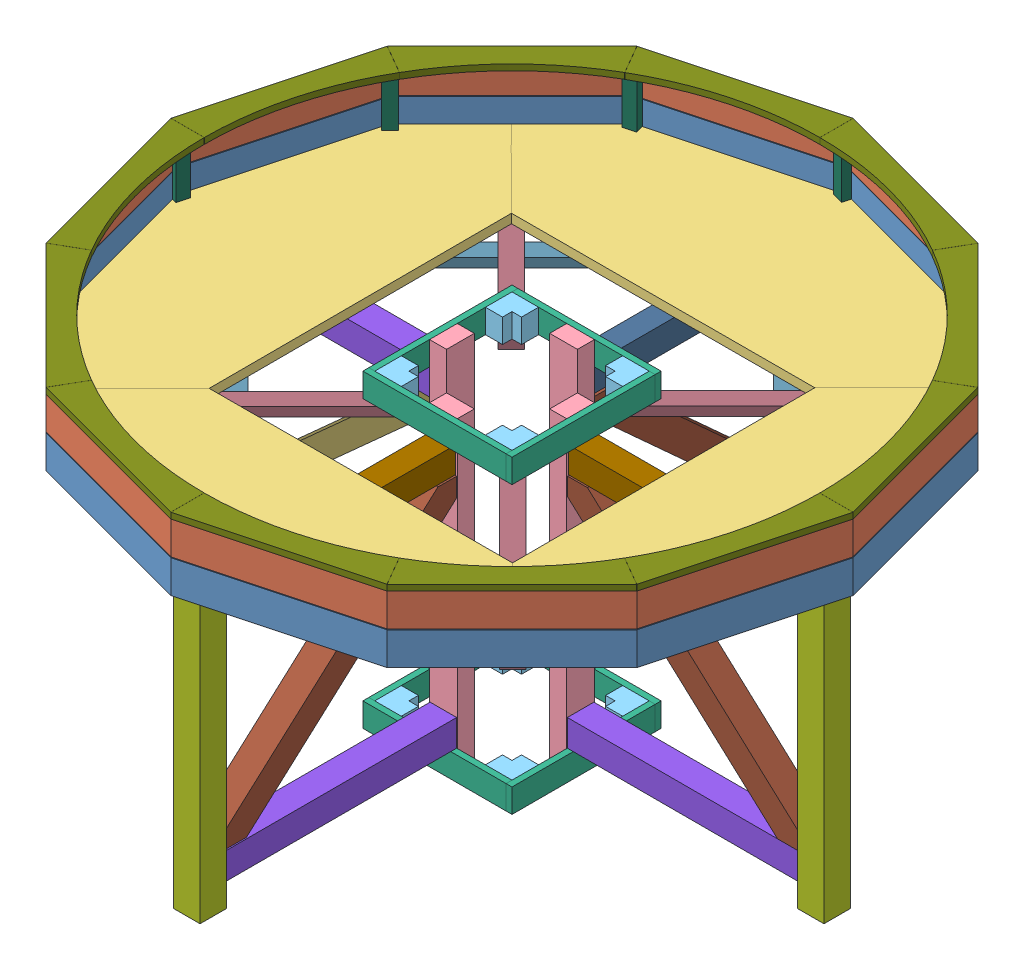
SolidWorks assembly SUPPORT.SLDASM, configuration Défaut (file format 8000). Lengths in mm.
Overall size (2309.42 902 2309.42).
96 component instances, 16 part files, 133 mates.
Components (placement in the parent):
- BORD_BAS-1: BORD_BAS.SLDPRT [Défaut] at (-699.0628 457.7092 -643.598) x (0.965926 0 0.258819) z (-0.258819 0 0.965926) size (15 90.5 445)
- BORD_HAUT-1: BORD_HAUT.SLDPRT [Défaut] at (-699.0628 542.2092 -643.598) x (0.965926 0 0.258819) z (-0.258819 0 0.965926) size (15 82.5 445)
- BORD_BAS-2: BORD_BAS.SLDPRT [Défaut] at (-386.2541 457.7092 -955.0497) x (0.707107 0 0.707107) z (-0.707107 0 0.707107) size (15 90.5 445)
- BORD_BAS-3: BORD_BAS.SLDPRT [Défaut] at (40.3721 457.7092 -1068.3704) x (0.258819 0 0.965926) z (-0.965926 0 0.258819) size (15 90.5 445)
- BORD_BAS-4: BORD_BAS.SLDPRT [Défaut] at (466.5015 457.7092 -953.1959) x (-0.258819 0 0.965926) z (-0.965926 0 -0.258819) size (15 90.5 445)
- BORD_BAS-5: BORD_BAS.SLDPRT [Défaut] at (777.9531 457.7092 -640.3872) x (-0.707107 0 0.707107) z (-0.707107 0 -0.707107) size (15 90.5 445)
- BORD_BAS-6: BORD_BAS.SLDPRT [Défaut] at (891.2738 457.7092 -213.761) x (-0.965926 0 0.258819) z (-0.258819 0 -0.965926) size (15 90.5 445)
- BORD_BAS-7: BORD_BAS.SLDPRT [Défaut] at (776.0993 457.7092 212.3684) x (-0.965926 0 -0.258819) z (0.258819 0 -0.965926) size (15 90.5 445)
- BORD_BAS-8: BORD_BAS.SLDPRT [Défaut] at (463.2906 457.7092 523.8201) x (-0.707107 0 -0.707107) z (0.707107 0 -0.707107) size (15 90.5 445)
- BORD_BAS-9: BORD_BAS.SLDPRT [Défaut] at (36.6645 457.7092 637.1407) x (-0.258819 0 -0.965926) z (0.965926 0 -0.258819) size (15 90.5 445)
- BORD_BAS-10: BORD_BAS.SLDPRT [Défaut] at (-389.4649 457.7092 521.9663) x (0.258819 0 -0.965926) z (0.965926 0 0.258819) size (15 90.5 445)
- BORD_BAS-11: BORD_BAS.SLDPRT [Défaut] at (-700.9166 457.7092 209.1575) x (0.707107 0 -0.707107) z (0.707107 0 0.707107) size (15 90.5 445)
- BORD_BAS-12: BORD_BAS.SLDPRT [Défaut] at (-814.2373 457.7092 -217.4686) x (0.965926 0 -0.258819) z (0.258819 0 0.965926) size (15 90.5 445)
- BORD_HAUT-2: BORD_HAUT.SLDPRT [Défaut] at (-386.2541 542.2092 -955.0497) x (0.707107 0 0.707107) z (-0.707107 0 0.707107) size (15 82.5 445)
- BORD_HAUT-3: BORD_HAUT.SLDPRT [Défaut] at (40.3721 542.2092 -1068.3704) x (0.258819 0 0.965926) z (-0.965926 0 0.258819) size (15 82.5 445)
- BORD_HAUT-4: BORD_HAUT.SLDPRT [Défaut] at (466.5015 542.2092 -953.1959) x (-0.258819 0 0.965926) z (-0.965926 0 -0.258819) size (15 82.5 445)
- BORD_HAUT-5: BORD_HAUT.SLDPRT [Défaut] at (777.9531 542.2092 -640.3872) x (-0.707107 0 0.707107) z (-0.707107 0 -0.707107) size (15 82.5 445)
- BORD_HAUT-6: BORD_HAUT.SLDPRT [Défaut] at (891.2738 542.2092 -213.761) x (-0.965926 0 0.258819) z (-0.258819 0 -0.965926) size (15 82.5 445)
- BORD_HAUT-7: BORD_HAUT.SLDPRT [Défaut] at (776.0993 542.2092 212.3684) x (-0.965926 0 -0.258819) z (0.258819 0 -0.965926) size (15 82.5 445)
- BORD_HAUT-8: BORD_HAUT.SLDPRT [Défaut] at (463.2906 542.2092 523.8201) x (-0.707107 0 -0.707107) z (0.707107 0 -0.707107) size (15 82.5 445)
- BORD_HAUT-9: BORD_HAUT.SLDPRT [Défaut] at (36.6645 542.2092 637.1407) x (-0.258819 0 -0.965926) z (0.965926 0 -0.258819) size (15 82.5 445)
- BORD_HAUT-10: BORD_HAUT.SLDPRT [Défaut] at (-389.4649 542.2092 521.9663) x (0.258819 0 -0.965926) z (0.965926 0 0.258819) size (15 82.5 445)
- BORD_HAUT-11: BORD_HAUT.SLDPRT [Défaut] at (-700.9166 542.2092 209.1575) x (0.707107 0 -0.707107) z (0.707107 0 0.707107) size (15 82.5 445)
- BORD_HAUT-12: BORD_HAUT.SLDPRT [Défaut] at (-814.2373 542.2092 -217.4686) x (0.965926 0 -0.258819) z (0.258819 0 0.965926) size (15 82.5 445)
- PLAQUE_SUPPORT-1: PLAQUE_SUPPORT.SLDPRT [Défaut] at (38.6306 416.4592 -215.6148) x (0.705881 0 -0.70833) z (0.70833 0 0.705881) size (816.21 23 816.96)
- PLAQUE_SUPPORT-2: PLAQUE_SUPPORT.SLDPRT [Défaut] at (38.5183 416.4592 -215.5025) x (0.70833 0 0.705881) z (-0.705881 0 0.70833) size (816.21 23 816.96)
- PLAQUE_SUPPORT-3: PLAQUE_SUPPORT.SLDPRT [Défaut] at (38.4059 416.4592 -215.6148) x (-0.705881 0 0.70833) z (-0.70833 0 -0.705881) size (816.21 23 816.96)
- PLAQUE_SUPPORT-4: PLAQUE_SUPPORT.SLDPRT [Défaut] at (38.5183 416.4592 -215.7271) x (-0.70833 0 -0.705881) z (0.705881 0 -0.70833) size (816.21 23 816.96)
- PIQUET_INT-1: PIQUET_INT.SLDPRT [Défaut] at (38.5183 -303.5408 -367.1148) size (70 780 43)
- PIQUET_INT-2: PIQUET_INT.SLDPRT [Défaut] at (-112.9817 -303.5408 -215.6148) x (0 0 -1) z (1 0 0) size (70 780 43)
- PIQUET_INT-3: PIQUET_INT.SLDPRT [Défaut] at (38.5183 -303.5408 -64.1148) x (-1 0 0) z (0 0 -1) size (70 780 43)
- PIQUET_INT-4: PIQUET_INT.SLDPRT [Défaut] at (190.0183 -303.5408 -215.6148) x (0 0 1) z (-1 0 0) size (70 780 43)
- BLOC_MAINTIEN-1: BLOC_MAINTIEN.SLDPRT [Défaut] at (-100.9817 -303.5408 -76.1148) size (67 60 67)
- BLOC_MAINTIEN-5: BLOC_MAINTIEN.SLDPRT [Défaut] at (-100.9817 416.4592 -76.1148) size (67 60 67)
- BLOC_MAINTIEN-12: BLOC_MAINTIEN.SLDPRT [Défaut] at (-100.9817 -303.5408 -355.1148) x (0 0 1) z (-1 0 0) size (67 60 67)
- BLOC_MAINTIEN-13: BLOC_MAINTIEN.SLDPRT [Défaut] at (178.0183 -303.5408 -355.1148) x (-1 0 0) z (0 0 -1) size (67 60 67)
- BLOC_MAINTIEN-14: BLOC_MAINTIEN.SLDPRT [Défaut] at (178.0183 -303.5408 -76.1148) x (0 0 -1) z (1 0 0) size (67 60 67)
- BLOC_MAINTIEN-15: BLOC_MAINTIEN.SLDPRT [Défaut] at (-100.9817 416.4592 -355.1148) x (0 0 1) z (-1 0 0) size (67 60 67)
- BLOC_MAINTIEN-16: BLOC_MAINTIEN.SLDPRT [Défaut] at (178.0183 416.4592 -355.1148) x (-1 0 0) z (0 0 -1) size (67 60 67)
- BLOC_MAINTIEN-17: BLOC_MAINTIEN.SLDPRT [Défaut] at (178.0183 416.4592 -76.1148) x (0 0 -1) z (1 0 0) size (67 60 67)
- FIXATION_BLOC-1: FIXATION_BLOC.SLDPRT [Défaut] at (46.0183 446.4592 -388.6148) x (-1 0 0) z (0 0 -1) size (361 60 15)
- FIXATION_BLOC-2: FIXATION_BLOC.SLDPRT [Défaut] at (226.5183 446.4592 -208.1148) x (0 0 1) z (-1 0 0) size (361 60 15)
- FIXATION_BLOC-3: FIXATION_BLOC.SLDPRT [Défaut] at (-134.4817 446.4592 -223.1148) x (0 0 1) z (-1 0 0) size (361 60 15)
- FIXATION_BLOC-4: FIXATION_BLOC.SLDPRT [Défaut] at (31.0183 446.4592 -27.6148) x (-1 0 0) z (0 0 -1) size (361 60 15)
- FIXATION_BLOC-5: FIXATION_BLOC.SLDPRT [Défaut] at (31.0183 -273.5408 -27.6148) x (-1 0 0) z (0 0 -1) size (361 60 15)
- FIXATION_BLOC-6: FIXATION_BLOC.SLDPRT [Défaut] at (-149.4817 -273.5408 -223.1148) x (0 0 -1) z (1 0 0) size (361 60 15)
- FIXATION_BLOC-7: FIXATION_BLOC.SLDPRT [Défaut] at (46.0183 -273.5408 -403.6148) size (361 60 15)
- FIXATION_BLOC-8: FIXATION_BLOC.SLDPRT [Défaut] at (226.5183 -273.5408 -208.1148) x (0 0 1) z (-1 0 0) size (361 60 15)
- PIQUET_EXT-1: PIQUET_EXT.SLDPRT [Défaut] at (38.5183 -303.5408 -1002.1148) size (67 720 67)
- PIQUET_EXT-2: PIQUET_EXT.SLDPRT [Défaut] at (825.0183 -303.5408 -215.6148) x (0 0 1) z (-1 0 0) size (67 720 67)
- PIQUET_EXT-3: PIQUET_EXT.SLDPRT [Défaut] at (38.5183 -303.5408 570.8852) x (-1 0 0) z (0 0 -1) size (67 720 67)
- PIQUET_EXT-4: PIQUET_EXT.SLDPRT [Défaut] at (-747.9817 -303.5408 -215.6148) x (0 0 -1) z (1 0 0) size (67 720 67)
- POUTRE_SUPPORT_67x67-1: POUTRE_SUPPORT_67x67.SLDPRT [Défaut] at (211.5183 -210.0408 -215.6148) x (0 0 -1) z (1 0 0) size (67 67 580)
- POUTRE_SUPPORT_67x67-2: POUTRE_SUPPORT_67x67.SLDPRT [Défaut] at (38.5183 -210.0408 -42.6148) size (67 67 580)
- POUTRE_SUPPORT_67x67-3: POUTRE_SUPPORT_67x67.SLDPRT [Défaut] at (-134.4817 -210.0408 -215.6148) x (0 0 1) z (-1 0 0) size (67 67 580)
- POUTRE_SUPPORT_67x67-4: POUTRE_SUPPORT_67x67.SLDPRT [Défaut] at (38.5183 -210.0408 -388.6148) x (-1 0 0) z (0 0 -1) size (67 67 580)
- POUTRE_SUPPORT_67x67-5: POUTRE_SUPPORT_67x67.SLDPRT [Défaut] at (-134.4817 382.9592 -215.6148) x (0 0 1) z (-1 0 0) size (67 67 580)
- POUTRE_SUPPORT_65x60-1: POUTRE_SUPPORT_65x60.SLDPRT [Défaut] at (38.5183 383.9592 -42.6148) x (0 1 0) z (0 0 1) size (65 60 580)
- POUTRE_SUPPORT_65x60-2: POUTRE_SUPPORT_65x60.SLDPRT [Défaut] at (211.5183 383.9592 -215.6148) x (0 -1 0) z (1 0 0) size (65 60 580)
- POUTRE_SUPPORT_65x55-1: POUTRE_SUPPORT_65x55.SLDPRT [Défaut] at (38.5183 383.9592 -968.6148) x (0 1 0) z (0 0 1) size (65 55 580)
- TRAVERSE_67x67-1: TRAVERSE_67x67.SLDPRT [Défaut] at (38.5183 350.1094 -45.1675) x (1 0 0) z (0 -0.668179 0.744001) size (67 67 783)
- TRAVERSE_67x67-2: TRAVERSE_67x67.SLDPRT [Défaut] at (212.3415 350.7256 -215.6148) x (0 0 -1) z (0.739285 -0.673393 0) size (67 67 783)
- TRAVERSE_67x67-3: TRAVERSE_67x67.SLDPRT [Défaut] at (38.5183 350.7256 -389.438) x (-1 0 0) z (0 -0.673393 -0.739285) size (67 67 783)
- TRAVERSE_65x55-1: TRAVERSE_65x55.SLDPRT [Défaut] at (-716.2399 -174.9896 -215.6148) x (0 0 1) z (0.742986 0.669307 0) size (65 55 783)
- LATTE_SUPPORT_62-1: LATTE_SUPPORT_62.SLDPRT [Défaut] at (606.207 404.9592 -784.7385) x (0.707107 0 0.707107) z (-0.707107 0 0.707107) size (47 23 620)
- LATTE_SUPPORT_62-2: LATTE_SUPPORT_62.SLDPRT [Défaut] at (607.6419 404.9592 352.0739) x (-0.707107 0 0.707107) z (-0.707107 0 -0.707107) size (47 23 620)
- LATTE_SUPPORT_62-3: LATTE_SUPPORT_62.SLDPRT [Défaut] at (-529.1705 404.9592 353.5089) x (-0.707107 0 -0.707107) z (0.707107 0 -0.707107) size (47 23 620)
- LATTE_SUPPORT_62-4: LATTE_SUPPORT_62.SLDPRT [Défaut] at (-530.6054 404.9592 -783.3035) x (0.707107 0 -0.707107) z (0.707107 0 0.707107) size (47 23 620)
- LATTE_SUPPORT_117-2: LATTE_SUPPORT_117.SLDPRT [Défaut] at (82.6353 381.9592 -863.8649) x (0.707107 0 -0.707107) z (0.707107 0 0.707107) size (47 23 944.84)
- LATTE_SUPPORT_117-3: LATTE_SUPPORT_117.SLDPRT [Défaut] at (686.7684 381.9592 -168.9978) x (0.707107 0 0.707107) z (-0.707107 0 0.707107) size (47 23 944.84)
- LATTE_SUPPORT_117-4: LATTE_SUPPORT_117.SLDPRT [Défaut] at (-607.2319 381.9592 -265.7318) x (-0.707107 0 -0.707107) z (0.707107 0 -0.707107) size (47 23 944.84)
- LATTE_SUPPORT_117-5: LATTE_SUPPORT_117.SLDPRT [Défaut] at (-8.0987 381.9592 436.1353) x (-0.707107 0 0.707107) z (-0.707107 0 -0.707107) size (47 23 944.84)
- FIXATION_BORD-1: FIXATION_BORD.SLDPRT [Défaut] at (-685.057 439.4592 -631.498) x (-0.707107 0 0.707107) z (-0.707107 0 -0.707107) size (30 144 20)
- FIXATION_BORD-2: FIXATION_BORD.SLDPRT [Défaut] at (-380.1748 439.4592 -937.5678) x (-0.965926 0 0.258819) z (-0.258819 0 -0.965926) size (30 144 20)
- FIXATION_BORD-3: FIXATION_BORD.SLDPRT [Défaut] at (36.896 439.4592 -1050.191) x (-0.965926 0 -0.258819) z (0.258819 0 -0.965926) size (30 144 20)
- FIXATION_BORD-4: FIXATION_BORD.SLDPRT [Défaut] at (454.4014 439.4592 -939.1901) x (-0.707107 0 -0.707107) z (0.707107 0 -0.707107) size (30 144 20)
- FIXATION_BORD-5: FIXATION_BORD.SLDPRT [Défaut] at (760.4713 439.4592 -634.3078) x (-0.258819 0 -0.965926) z (0.965926 0 -0.258819) size (30 144 20)
- FIXATION_BORD-6: FIXATION_BORD.SLDPRT [Défaut] at (873.0944 439.4592 -217.2371) x (0.258819 0 -0.965926) z (0.965926 0 0.258819) size (30 144 20)
- FIXATION_BORD-7: FIXATION_BORD.SLDPRT [Défaut] at (762.0936 439.4592 200.2684) x (0.707107 0 -0.707107) z (0.707107 0 0.707107) size (30 144 20)
- FIXATION_BORD-8: FIXATION_BORD.SLDPRT [Défaut] at (457.2113 439.4592 506.3382) x (0.965926 0 -0.258819) z (0.258819 0 0.965926) size (30 144 20)
- FIXATION_BORD-9: FIXATION_BORD.SLDPRT [Défaut] at (40.1405 439.4592 618.9614) x (0.965926 0 0.258819) z (-0.258819 0 0.965926) size (30 144 20)
- FIXATION_BORD-10: FIXATION_BORD.SLDPRT [Défaut] at (-377.3649 439.4592 507.9605) x (0.707107 0 0.707107) z (-0.707107 0 0.707107) size (30 144 20)
- FIXATION_BORD-11: FIXATION_BORD.SLDPRT [Défaut] at (-683.4348 439.4592 203.0782) x (0.258819 0 0.965926) z (-0.965926 0 0.258819) size (30 144 20)
- FIXATION_BORD-12: FIXATION_BORD.SLDPRT [Défaut] at (-796.0579 439.4592 -213.9925) x (-0.258819 0 0.965926) z (-0.965926 0 -0.258819) size (30 144 20)
- REBORD-1: REBORD.SLDPRT [Défaut] at (-763.8481 583.4592 -430.7939) x (0.258819 0 -0.965926) z (0.965926 0 0.258819) size (445 15 81.12)
- REBORD-2: REBORD.SLDPRT [Défaut] at (-548.7618 583.4592 -803.1485) x (0.707107 0 -0.707107) z (0.707107 0 0.707107) size (445 15 81.12)
- REBORD-3: REBORD.SLDPRT [Défaut] at (-176.3144 583.4592 -1018.074) x (0.965926 0 -0.258819) z (0.258819 0 0.965926) size (445 15 81.12)
- REBORD-4: REBORD.SLDPRT [Défaut] at (253.6973 583.4592 -1017.9811) x (0.965926 0 0.258819) z (-0.258819 0 0.965926) size (445 15 81.12)
- REBORD-5: REBORD.SLDPRT [Défaut] at (626.052 583.4592 -802.8949) x (0.707107 0 0.707107) z (-0.707107 0 0.707107) size (445 15 81.12)
- REBORD-6: REBORD.SLDPRT [Défaut] at (840.9774 583.4592 -430.4474) x (0.258819 0 0.965926) z (-0.965926 0 0.258819) size (445 15 81.12)
- REBORD-7: REBORD.SLDPRT [Défaut] at (840.8846 583.4592 -0.4357) x (-0.258819 0 0.965926) z (-0.965926 0 -0.258819) size (445 15 81.12)
- REBORD-8: REBORD.SLDPRT [Défaut] at (625.7984 583.4592 371.9189) x (-0.707107 0 0.707107) z (-0.707107 0 -0.707107) size (445 15 81.12)
- REBORD-9: REBORD.SLDPRT [Défaut] at (253.3509 583.4592 586.8444) x (-0.965926 0 0.258819) z (-0.258819 0 -0.965926) size (445 15 81.12)
- REBORD-10: REBORD.SLDPRT [Défaut] at (-176.6608 583.4592 586.7515) x (-0.965926 0 -0.258819) z (0.258819 0 -0.965926) size (445 15 81.12)
- REBORD-11: REBORD.SLDPRT [Défaut] at (-549.0154 583.4592 371.6653) x (-0.707107 0 -0.707107) z (0.707107 0 -0.707107) size (445 15 81.12)
- REBORD-12: REBORD.SLDPRT [Défaut] at (-763.9409 583.4592 -0.7822) x (-0.258819 0 -0.965926) z (0.965926 0 -0.258819) size (445 15 81.12)
Mates (geometry in assembly coordinates):
- Coïncidente22: coincident aligned: line of ? through (168.5183 -303.5408 -108.6148) axis (0 1 0); line of ? through (168.5183 -303.5408 -108.6148) axis (0 1 0)
- Coïncidente23: coincident aligned: plane of ? through (-68.4817 -303.5408 -85.6148) normal (0 -1 0); plane of ? through (145.5183 -303.5408 -108.6148) normal (0 -1 0)
- Coïncidente24: coincident aligned: plane of ? through (145.5183 -303.5408 -345.6148) normal (0 -1 0); plane of ? through (145.5183 -303.5408 -108.6148) normal (0 -1 0)
- Coïncidente25: coincident anti-aligned: plane of ? through (145.5183 -303.5408 -322.6148) normal (0 0 1); plane of ? through (-68.4817 -303.5408 -322.6148) normal (0 0 -1)
- Coïncidente26: coincident aligned: plane of ? through (145.5183 -303.5408 -345.6148) normal (0 -1 0); plane of ? through (-68.4817 -303.5408 -322.6148) normal (0 -1 0)
- Coïncidente27: coincident aligned: line of ? through (-91.4817 -303.5408 -322.6148) axis (0 1 0); line of ? through (-91.4817 -303.5408 -322.6148) axis (0 1 0)
- Coïncidente29: coincident anti-aligned: plane of ? through (-68.4817 -303.5408 -108.6148) normal (0 0 -1); plane of ? through (145.5183 -303.5408 -108.6148) normal (0 0 1)
- Coïncidente35: coincident anti-aligned: plane of ? through (145.5183 1909.0592 -345.6148) normal (1 0 0); plane of ? through (145.5183 1909.0592 -108.6148) normal (-1 0 0)
- Coïncidente36: coincident aligned: line of ? through (145.5183 1909.0592 -345.6148) axis (0 -1 0); line of ? through (145.5183 1909.0592 -345.6148) axis (0 -1 0)
- Distance1: distance = 860 mm: line of BORD_BAS-1 through (-821.4817 416.4592 -215.7022) axis (0 1 0); line of assembly; line of BORD_BAS-1; line of assembly
- Distance2: distance = 860 mm: line of BORD_BAS-1 through (-706.3073 416.4592 -645.5391) axis (0 1 0)
- Perpendiculaire2: perpendicular: plane of ? through (145.5183 -303.5408 -322.6148) normal (0 0 1); plane of ? through (145.5183 1909.0592 -108.6148) normal (-1 0 0)
- Perpendiculaire3: perpendicular: plane of ? through (-68.4817 -303.5408 -108.6148) normal (0 0 -1); plane of ? through (145.5183 1909.0592 -108.6148) normal (-1 0 0)
- Perpendiculaire4: perpendicular: plane of ? through (145.5183 -303.5408 -322.6148) normal (0 0 1); plane of ? through (-68.4817 1909.0592 -322.6148) normal (1 0 0)
- Perpendiculaire5: perpendicular: plane of ? through (145.5183 -303.5408 -322.6148) normal (0 0 1); plane of ? through (145.5183 1909.0592 -108.6148) normal (-1 0 0)
- Parallèle10: parallel aligned: plane of ? through (-68.4817 -303.5408 -85.6148) normal (0 0 1); plane of BORD_BAS-1 through (-805.9526 416.4592 -215.7022) normal (0 0 1)
- Perpendiculaire6: perpendicular: plane of ? through (-91.4817 -303.5408 -322.6148) normal (-1 0 0); plane of BORD_BAS-1 through (-805.9526 416.4592 -215.7022) normal (0 0 1)
- Distance3: distance = 720 mm aligned: plane of BORD_BAS-1 through (-814.2373 416.4592 -213.761) normal (0 -1 0); plane of ? through (-68.4817 -303.5408 -322.6148) normal (0 -1 0)
- Coïncidente48: coincident aligned: plane of BORD_BAS-1 through (-821.4817 457.7092 -215.7022) normal (-0.965926 0 -0.258819); plane of BORD_HAUT-1 through (-821.4817 542.2092 -215.7022) normal (-0.965926 0 -0.258819)
- Coïncidente49: coincident aligned: plane of BORD_BAS-1 through (-805.9526 416.4592 -215.7022) normal (0 0 1); plane of BORD_HAUT-1 through (-805.9526 500.9592 -215.7022) normal (0 0 1)
- Coïncidente50: coincident anti-aligned: plane of BORD_BAS-1 through (-814.2373 506.9592 -213.761) normal (0 1 0); plane of BORD_HAUT-1 through (-814.2373 506.9592 -213.761) normal (0 -1 0)
- Coïncidente53: coincident: plane of BORD_BAS-12 through (-691.8184 457.7092 210.4273) normal (0.965926 0 -0.258819); plane of PLAQUE_SUPPORT-1 through (-749.3981 439.4592 -4.4632) normal (-0.965926 0 0.258819)
- Coïncidente54: coincident: plane of BORD_BAS-1 through (-806.9928 457.7092 -211.8199) normal (0.965926 0 0.258819); plane of PLAQUE_SUPPORT-1 through (-749.3981 439.4592 -426.7665) normal (-0.965926 0 -0.258819)
- Coïncidente59: coincident: plane of BORD_BAS-12 through (-699.0628 416.4592 212.3684) normal (0 -1 0); plane of PLAQUE_SUPPORT-1 through (38.6306 416.4592 -215.6148) normal (0 -1 0); plane of PIQUET_INT-1; plane of assembly
- Perpendiculaire7: perpendicular: plane of PIQUET_INT-1 through (3.5183 476.4592 -345.6148) normal (0 0 1); plane of assembly through (38.5183 0 0) normal (1 0 0)
- Coïncidente61: coincident anti-aligned: plane of ? through (145.5183 -303.5408 -345.6148) normal (0 0 -1); plane of PIQUET_INT-1 through (3.5183 476.4592 -345.6148) normal (0 0 1)
- Coïncidente62: coincident aligned: plane of ? through (145.5183 -303.5408 -345.6148) normal (0 -1 0); plane of PIQUET_INT-1 through (38.5183 -303.5408 -367.1148) normal (0 -1 0)
- Distance4: distance = 95 mm aligned: plane of PIQUET_INT-1 through (3.5183 476.4592 -388.6148) normal (-1 0 0); plane of ? through (-91.4817 -303.5408 -322.6148) normal (-1 0 0)
- Coïncidente64: coincident anti-aligned: plane of ? through (-91.4817 -303.5408 -322.6148) normal (-1 0 0); plane of PIQUET_INT-2 through (-91.4817 476.4592 -180.6148) normal (1 0 0)
- Coïncidente65: coincident aligned: plane of ? through (-68.4817 -303.5408 -322.6148) normal (0 -1 0); plane of PIQUET_INT-2 through (-112.9817 -303.5408 -215.6148) normal (0 -1 0)
- Distance5: distance = 95 mm aligned: plane of PIQUET_INT-2 through (-134.4817 476.4592 -180.6148) normal (0 0 1); plane of ? through (-68.4817 -303.5408 -85.6148) normal (0 0 1)
- Coïncidente67: coincident anti-aligned: plane of ? through (168.5183 -303.5408 -108.6148) normal (1 0 0); plane of PIQUET_INT-4 through (168.5183 476.4592 -250.6148) normal (-1 0 0)
- Coïncidente68: coincident aligned: plane of ? through (145.5183 -303.5408 -108.6148) normal (0 -1 0); plane of PIQUET_INT-4 through (190.0183 -303.5408 -215.6148) normal (0 -1 0)
- Distance6: distance = 95 mm aligned: plane of PIQUET_INT-4 through (211.5183 476.4592 -180.6148) normal (0 0 1); plane of ? through (-68.4817 -303.5408 -85.6148) normal (0 0 1)
- Coïncidente70: coincident anti-aligned: plane of ? through (-68.4817 -303.5408 -85.6148) normal (0 0 1); plane of PIQUET_INT-3 through (73.5183 476.4592 -85.6148) normal (0 0 -1)
- Coïncidente71: coincident aligned: plane of ? through (-68.4817 -303.5408 -85.6148) normal (0 -1 0); plane of PIQUET_INT-3 through (38.5183 -303.5408 -64.1148) normal (0 -1 0)
- Distance7: distance = 95 mm aligned: plane of PIQUET_INT-3 through (3.5183 476.4592 -42.6148) normal (-1 0 0); plane of ? through (-91.4817 -303.5408 -322.6148) normal (-1 0 0)
- Coïncidente73: coincident anti-aligned: plane of ? through (-91.4817 -303.5408 -322.6148) normal (-1 0 0); plane of BLOC_MAINTIEN-1 through (-91.4817 -243.5408 -76.1148) normal (1 0 0)
- Coïncidente74: coincident anti-aligned: plane of ? through (-68.4817 -303.5408 -85.6148) normal (0 0 1); plane of BLOC_MAINTIEN-1 through (-100.9817 -243.5408 -85.6148) normal (0 0 -1)
- Coïncidente75: coincident aligned: plane of ? through (-68.4817 -303.5408 -85.6148) normal (0 -1 0); plane of BLOC_MAINTIEN-1 through (-100.9817 -303.5408 -76.1148) normal (0 -1 0)
- Coïncidente76: coincident anti-aligned: plane of BLOC_MAINTIEN-12 through (-100.9817 -243.5408 -388.6148) normal (0 0 -1); plane of FIXATION_BLOC-7 through (46.0183 -273.5408 -388.6148) normal (0 0 1)
- Coïncidente77: coincident: plane of BLOC_MAINTIEN-12 through (-134.4817 -243.5408 -355.1148) normal (-1 0 0); plane of FIXATION_BLOC-7 through (-134.4817 -243.5408 -388.6148) normal (-1 0 0)
- Coïncidente78: coincident aligned: plane of BLOC_MAINTIEN-12 through (-100.9817 -243.5408 -355.1148) normal (0 1 0); plane of FIXATION_BLOC-7 through (-134.4817 -243.5408 -388.6148) normal (0 1 0)
- Coïncidente79: coincident: plane of BLOC_MAINTIEN-12 through (-134.4817 -243.5408 -355.1148) normal (-1 0 0); plane of FIXATION_BLOC-6 through (-134.4817 -273.5408 -223.1148) normal (1 0 0)
- Coïncidente80: coincident: plane of BLOC_MAINTIEN-1 through (-100.9817 -243.5408 -42.6148) normal (0 0 1); plane of FIXATION_BLOC-6 through (-134.4817 -243.5408 -42.6148) normal (0 0 1)
- Coïncidente81: coincident: plane of BLOC_MAINTIEN-1 through (-100.9817 -243.5408 -76.1148) normal (0 1 0); plane of FIXATION_BLOC-6 through (-134.4817 -243.5408 -42.6148) normal (0 1 0)
- Coïncidente82: coincident: plane of BLOC_MAINTIEN-1 through (-100.9817 -243.5408 -42.6148) normal (0 0 1); plane of FIXATION_BLOC-5 through (31.0183 -273.5408 -42.6148) normal (0 0 -1)
- Coïncidente83: coincident: plane of BLOC_MAINTIEN-14 through (211.5183 -243.5408 -76.1148) normal (1 0 0); plane of FIXATION_BLOC-5 through (211.5183 -243.5408 -42.6148) normal (1 0 0)
- Coïncidente84: coincident: plane of BLOC_MAINTIEN-1 through (-100.9817 -243.5408 -76.1148) normal (0 1 0); plane of FIXATION_BLOC-5 through (211.5183 -243.5408 -42.6148) normal (0 1 0)
- Coïncidente85: coincident: plane of BLOC_MAINTIEN-13 through (211.5183 -243.5408 -355.1148) normal (1 0 0); plane of FIXATION_BLOC-8 through (211.5183 -273.5408 -208.1148) normal (-1 0 0)
- Coïncidente86: coincident: plane of BLOC_MAINTIEN-13 through (178.0183 -243.5408 -355.1148) normal (0 1 0); plane of FIXATION_BLOC-8 through (211.5183 -243.5408 -388.6148) normal (0 1 0)
- Coïncidente87: coincident: plane of FIXATION_BLOC-5 through (31.0183 -273.5408 -27.6148) normal (0 0 1); plane of FIXATION_BLOC-8 through (211.5183 -243.5408 -27.6148) normal (0 0 1)
- Coïncidente88: coincident: plane of BLOC_MAINTIEN-5 through (-100.9817 476.4592 -42.6148) normal (0 0 1); plane of FIXATION_BLOC-4 through (31.0183 446.4592 -42.6148) normal (0 0 -1)
- Coïncidente89: coincident: plane of BLOC_MAINTIEN-5 through (-100.9817 476.4592 -76.1148) normal (0 1 0); plane of FIXATION_BLOC-4 through (211.5183 476.4592 -42.6148) normal (0 1 0)
- Coïncidente90: coincident: plane of BLOC_MAINTIEN-17 through (211.5183 476.4592 -76.1148) normal (1 0 0); plane of FIXATION_BLOC-4 through (211.5183 476.4592 -42.6148) normal (1 0 0)
- Coïncidente91: coincident: plane of BLOC_MAINTIEN-17 through (211.5183 476.4592 -76.1148) normal (1 0 0); plane of FIXATION_BLOC-2 through (211.5183 446.4592 -208.1148) normal (-1 0 0)
- Coïncidente92: coincident: plane of FIXATION_BLOC-2 through (211.5183 476.4592 -27.6148) normal (0 0 1); plane of FIXATION_BLOC-4 through (31.0183 446.4592 -27.6148) normal (0 0 1)
- Coïncidente93: coincident: plane of BLOC_MAINTIEN-17 through (178.0183 476.4592 -76.1148) normal (0 1 0); plane of FIXATION_BLOC-2 through (211.5183 476.4592 -388.6148) normal (0 1 0)
- Coïncidente94: coincident: plane of BLOC_MAINTIEN-16 through (178.0183 476.4592 -388.6148) normal (0 0 -1); plane of FIXATION_BLOC-1 through (46.0183 446.4592 -388.6148) normal (0 0 1)
- Coïncidente95: coincident: plane of FIXATION_BLOC-1 through (226.5183 476.4592 -403.6148) normal (1 0 0); plane of FIXATION_BLOC-2 through (226.5183 446.4592 -208.1148) normal (1 0 0)
- Coïncidente96: coincident: plane of BLOC_MAINTIEN-16 through (178.0183 476.4592 -355.1148) normal (0 1 0); plane of FIXATION_BLOC-1 through (226.5183 476.4592 -403.6148) normal (0 1 0)
- Coïncidente97: coincident: plane of BLOC_MAINTIEN-15 through (-134.4817 476.4592 -355.1148) normal (-1 0 0); plane of FIXATION_BLOC-3 through (-134.4817 446.4592 -223.1148) normal (1 0 0)
- Coïncidente98: coincident: plane of FIXATION_BLOC-1 through (46.0183 446.4592 -403.6148) normal (0 0 -1); plane of FIXATION_BLOC-3 through (-149.4817 476.4592 -403.6148) normal (0 0 -1)
- Coïncidente99: coincident: plane of PIQUET_INT-2 through (-112.9817 476.4592 -215.6148) normal (0 1 0); plane of FIXATION_BLOC-3 through (-149.4817 476.4592 -403.6148) normal (0 1 0)
- Coïncidente100: coincident: plane of PLAQUE_SUPPORT-2 through (38.5183 416.4592 -215.5025) normal (0 -1 0); plane of PIQUET_EXT-1 through (38.5183 416.4592 -1002.1148) normal (0 1 0); plane of ?; plane of ?; plane of ?; plane of ?; plane of ?; plane of ?
- Parallèle18: parallel: plane of PIQUET_INT-1 through (3.5183 476.4592 -388.6148) normal (0 0 -1); plane of PIQUET_EXT-1 through (5.0183 416.4592 -968.6148) normal (0 0 1)
- Distance8: distance = 1.5 mm: plane of PIQUET_EXT-1 through (5.0183 416.4592 -1035.6148) normal (-1 0 0); plane of PIQUET_INT-1 through (3.5183 476.4592 -388.6148) normal (-1 0 0)
- Distance9: distance = 580 mm: plane of PIQUET_INT-1 through (3.5183 476.4592 -388.6148) normal (0 0 -1); plane of PIQUET_EXT-1 through (5.0183 416.4592 -968.6148) normal (0 0 1)
- Coïncidente104: coincident: plane of BLOC_MAINTIEN-13 through (178.0183 -243.5408 -355.1148) normal (0 1 0); plane of POUTRE_SUPPORT_67x67-1 through (791.5183 -243.5408 -182.1148) normal (0 -1 0)
- Coïncidente105: coincident: plane of PIQUET_INT-4 through (211.5183 476.4592 -250.6148) normal (1 0 0); plane of POUTRE_SUPPORT_67x67-1 through (211.5183 -210.0408 -215.6148) normal (-1 0 0)
- Coïncidente106: coincident: plane of PIQUET_EXT-2 through (858.5183 416.4592 -249.1148) normal (0 0 -1); plane of POUTRE_SUPPORT_67x67-1 through (791.5183 -176.5408 -249.1148) normal (0 0 -1)
- Coïncidente107: coincident: plane of PIQUET_INT-2 through (-134.4817 476.4592 -180.6148) normal (-1 0 0); plane of POUTRE_SUPPORT_67x67-5 through (-134.4817 382.9592 -215.6148) normal (1 0 0)
- Coïncidente108: coincident: plane of PLAQUE_SUPPORT-1 through (38.6306 416.4592 -215.6148) normal (0 -1 0); plane of POUTRE_SUPPORT_67x67-5 through (-714.4817 416.4592 -249.1148) normal (0 1 0)
- Coïncidente109: coincident: plane of PIQUET_EXT-4 through (-781.4817 416.4592 -249.1148) normal (0 0 -1); plane of POUTRE_SUPPORT_67x67-5 through (-714.4817 416.4592 -249.1148) normal (0 0 -1)
- Coïncidente110: coincident: plane of PIQUET_EXT-3 through (72.0183 416.4592 537.3852) normal (0 0 -1); plane of POUTRE_SUPPORT_65x60-1 through (38.5183 383.9592 537.3852) normal (0 0 1)
- Coïncidente111: coincident: plane of PLAQUE_SUPPORT-4 through (38.5183 416.4592 -215.7271) normal (0 -1 0); plane of POUTRE_SUPPORT_65x60-1 through (8.5183 416.4592 537.3852) normal (0 1 0); plane of POUTRE_SUPPORT_65x60-1; plane of PIQUET_EXT-3
- Distance10: distance = 3.5 mm: plane of POUTRE_SUPPORT_65x60-1 through (68.5183 351.4592 537.3852) normal (1 0 0); plane of PIQUET_EXT-3 through (72.0183 416.4592 604.3852) normal (1 0 0)
- Coïncidente113: coincident: plane of PIQUET_EXT-2 through (791.5183 416.4592 -249.1148) normal (-1 0 0); plane of POUTRE_SUPPORT_65x60-2 through (791.5183 383.9592 -215.6148) normal (1 0 0)
- Coïncidente114: coincident: plane of PLAQUE_SUPPORT-3 through (38.4059 416.4592 -215.6148) normal (0 -1 0); plane of POUTRE_SUPPORT_65x60-2 through (791.5183 416.4592 -245.6148) normal (0 1 0); plane of POUTRE_SUPPORT_65x60-2; plane of PIQUET_EXT-2
- Distance11: distance = 3.5 mm: plane of POUTRE_SUPPORT_65x60-2 through (791.5183 416.4592 -185.6148) normal (0 0 1); plane of PIQUET_EXT-2 through (858.5183 416.4592 -182.1148) normal (0 0 1)
- Coïncidente116: coincident: plane of PLAQUE_SUPPORT-2 through (38.5183 416.4592 -215.5025) normal (0 -1 0); plane of POUTRE_SUPPORT_65x55-1 through (11.0183 416.4592 -388.6148) normal (0 1 0)
- Coïncidente117: coincident: plane of PIQUET_EXT-1 through (5.0183 416.4592 -968.6148) normal (0 0 1); plane of POUTRE_SUPPORT_65x55-1 through (38.5183 383.9592 -968.6148) normal (0 0 -1)
- Distance12: distance = 6 mm: plane of POUTRE_SUPPORT_65x55-1 through (66.0183 351.4592 -388.6148) normal (1 0 0); plane of PIQUET_EXT-1 through (72.0183 416.4592 -1035.6148) normal (1 0 0)
- Coïncidente127: coincident: plane of PIQUET_EXT-3 through (5.0183 416.4592 604.3852) normal (-1 0 0); line of TRAVERSE_67x67-1 through (5.0183 -128.0476 537.3852) axis (0 0.668179 -0.744001)
- Coïncidente128: coincident: plane of PIQUET_EXT-3 through (72.0183 416.4592 537.3852) normal (0 0 -1); plane of TRAVERSE_67x67-1 through (5.0183 -173.0744 537.3852) normal (0 0 1); plane of POUTRE_SUPPORT_65x60-1; line of TRAVERSE_67x67-1
- Distance14: distance = 1 mm: plane of POUTRE_SUPPORT_65x60-1 through (8.5183 351.4592 537.3852) normal (0 -1 0); line of TRAVERSE_67x67-1 through (5.0183 350.4592 4.5794) axis (1 0 0)
- Coïncidente141: coincident: plane of POUTRE_SUPPORT_67x67-1 through (791.5183 -176.5408 -182.1148) normal (0 1 0); plane of TRAVERSE_67x67-2 through (791.2017 -176.5408 -182.1148) normal (0 -1 0)
- Coïncidente144: coincident: plane of PIQUET_EXT-2 through (858.5183 416.4592 -182.1148) normal (0 0 1); plane of TRAVERSE_67x67-2 through (813.7604 -151.7748 -182.1148) normal (0 0 1)
- Coïncidente145: coincident: plane of PIQUET_EXT-2 through (791.5183 416.4592 -249.1148) normal (-1 0 0); line of TRAVERSE_67x67-2 through (791.5183 -131.5151 -182.1148) axis (0 0 -1)
- Coïncidente146: coincident: plane of POUTRE_SUPPORT_67x67-4 through (72.0183 -176.5408 -968.6148) normal (0 1 0); plane of TRAVERSE_67x67-3 through (72.0183 -176.5408 -968.2983) normal (0 -1 0)
- Coïncidente147: coincident: plane of PIQUET_EXT-1 through (72.0183 416.4592 -1035.6148) normal (1 0 0); plane of TRAVERSE_67x67-3 through (72.0183 -151.7748 -990.8569) normal (1 0 0)
- Coïncidente155: coincident: line of TRAVERSE_67x67-3 through (72.0183 -131.5151 -968.6148) axis (-1 0 0); plane of PIQUET_EXT-1 through (5.0183 416.4592 -968.6148) normal (0 0 1)
- Coïncidente156: coincident: plane of PIQUET_INT-2 through (-134.4817 476.4592 -180.6148) normal (-1 0 0); plane of TRAVERSE_65x55-1 through (-134.4817 349.0776 -248.1148) normal (1 0 0)
- Coïncidente157: coincident: plane of POUTRE_SUPPORT_67x67-5 through (-714.4817 349.4592 -249.1148) normal (0 -1 0); line of TRAVERSE_65x55-1 through (-175.1454 349.4592 -248.1148) axis (0 0 1); plane of PIQUET_EXT-4; plane of TRAVERSE_65x55-1; plane of BORD_BAS-5; plane of LATTE_SUPPORT_62-1; line of PLAQUE_SUPPORT-3; plane of LATTE_SUPPORT_62-1
- Distance15: distance = 1 mm: plane of PIQUET_EXT-4 through (-781.4817 416.4592 -249.1148) normal (0 0 -1); plane of TRAVERSE_65x55-1 through (-116.0758 328.6454 -248.1148) normal (0 0 -1)
- Parallèle20: parallel: plane of BORD_BAS-5 through (468.5939 457.7092 -960.353) normal (0.707107 0 -0.707107); plane of LATTE_SUPPORT_62-1 through (606.207 404.9592 -784.7385) normal (0.707107 0 -0.707107)
- Distance16: distance = 23.5 mm: line of PLAQUE_SUPPORT-3 through (419.5817 439.4592 -598.1132) axis (0 -1 0); plane of LATTE_SUPPORT_62-1 through (151.1838 416.4592 -362.9493) normal (-0.707107 0 -0.707107)
- Coïncidente162: coincident: plane of PLAQUE_SUPPORT-3 through (38.4059 416.4592 -215.6148) normal (0 -1 0); plane of LATTE_SUPPORT_62-1 through (151.1838 416.4592 -362.9493) normal (0 1 0)
- Coïncidente163: coincident: line of ? through (168.5183 -303.5408 -345.6148) axis (0 1 0); plane of LATTE_SUPPORT_62-1 through (167.8008 404.9592 -346.3323) normal (-0.707107 0 0.707107)
- Coïncidente164: coincident: plane of PIQUET_EXT-1 through (72.0183 416.4592 -1035.6148) normal (1 0 0); line of ? through (72.0183 393.4592 -917.216) axis (0 -1 0)
- Coïncidente165: coincident anti-aligned: plane of LATTE_SUPPORT_62-1 through (151.1838 393.4592 -362.9493) normal (0 -1 0); plane of ? through (673.059 393.4592 -249.7072) normal (0 1 0)
- Coïncidente166: coincident: plane of PIQUET_EXT-2 through (858.5183 416.4592 -249.1148) normal (0 0 -1); line of ? through (740.1194 393.4592 -249.1148) axis (0 -1 0)
- Parallèle21: parallel aligned: plane of BORD_BAS-5 through (468.5939 457.7092 -960.353) normal (0.707107 0 -0.707107); plane of ? through (706.293 393.4592 -282.9412) normal (0.707107 0 -0.707107)
- Coïncidente168: coincident: plane of POUTRE_SUPPORT_65x55-1 through (66.0183 351.4592 -388.6148) normal (1 0 0); line of LATTE_SUPPORT_117-2 through (66.0183 393.4592 -913.716) axis (0 -1 0)
- Coïncidente169: coincident: plane of POUTRE_SUPPORT_65x60-2 through (791.5183 416.4592 -245.6148) normal (0 0 -1); line of LATTE_SUPPORT_117-2 through (734.1194 393.4592 -245.6148) axis (0 -1 0)
- Coïncidente170: coincident: plane of LATTE_SUPPORT_62-1 through (151.1838 393.4592 -362.9493) normal (0 -1 0); plane of LATTE_SUPPORT_117-2 through (667.059 393.4592 -246.2072) normal (0 1 0); plane of BORD_BAS-5; plane of LATTE_SUPPORT_117-2
- Parallèle22: parallel: plane of BORD_BAS-5 through (468.5939 457.7092 -960.353) normal (0.707107 0 -0.707107); plane of LATTE_SUPPORT_117-2 through (700.293 393.4592 -279.4412) normal (0.707107 0 -0.707107)
- Coïncidente171: coincident: plane of LATTE_SUPPORT_62-2 through (185.8528 393.4592 -102.9493) normal (0 -1 0); plane of LATTE_SUPPORT_117-3 through (69.1106 393.4592 415.426) normal (0 1 0)
- Coïncidente172: coincident: plane of POUTRE_SUPPORT_65x60-2 through (791.5183 416.4592 -185.6148) normal (0 0 1); line of LATTE_SUPPORT_117-3 through (736.6194 393.4592 -185.6148) axis (0 -1 0)
- Coïncidente173: coincident: plane of POUTRE_SUPPORT_65x60-1 through (68.5183 351.4592 537.3852) normal (1 0 0); line of LATTE_SUPPORT_117-3 through (68.5183 393.4592 482.4864) axis (0 -1 0); plane of BORD_BAS-8; plane of LATTE_SUPPORT_117-3
- Parallèle23: parallel: plane of BORD_BAS-8 through (783.2564 457.7092 214.4608) normal (0.707107 0 0.707107); plane of LATTE_SUPPORT_117-3 through (102.3446 393.4592 448.66) normal (0.707107 0 0.707107)
- Coïncidente175: coincident: plane of LATTE_SUPPORT_62-4 through (-108.8162 393.4592 -328.2803) normal (0 -1 0); plane of LATTE_SUPPORT_117-4 through (10.4259 393.4592 -850.1556) normal (0 1 0)
- Coïncidente176: coincident: plane of POUTRE_SUPPORT_65x55-1 through (11.0183 351.4592 -388.6148) normal (-1 0 0); line of LATTE_SUPPORT_117-4 through (11.0183 393.4592 -917.216) axis (0 -1 0)
- Coïncidente177: coincident: plane of POUTRE_SUPPORT_67x67-5 through (-714.4817 416.4592 -249.1148) normal (0 0 -1); line of LATTE_SUPPORT_117-4 through (-657.0829 393.4592 -249.1148) axis (0 -1 0)
- Parallèle24: parallel: plane of BORD_BAS-2 through (-706.2199 457.7092 -645.6905) normal (-0.707107 0 -0.707107); plane of LATTE_SUPPORT_117-4 through (-22.8081 393.4592 -883.3896) normal (-0.707107 0 -0.707107)
- Coïncidente179: coincident: plane of LATTE_SUPPORT_62-3 through (-74.1472 393.4592 -68.2803) normal (0 -1 0); plane of LATTE_SUPPORT_117-5 through (-592.5225 393.4592 -181.5224) normal (0 1 0)
- Coïncidente180: coincident: plane of POUTRE_SUPPORT_67x67-5 through (-714.4817 416.4592 -182.1148) normal (0 0 1); line of LATTE_SUPPORT_117-5 through (-659.5829 393.4592 -182.1148) axis (0 -1 0)
- Coïncidente181: coincident: plane of POUTRE_SUPPORT_65x60-1 through (8.5183 351.4592 537.3852) normal (-1 0 0); line of LATTE_SUPPORT_117-5 through (8.5183 393.4592 485.9864) axis (0 -1 0); plane of BORD_BAS-11; plane of LATTE_SUPPORT_117-5
- Parallèle25: parallel: plane of BORD_BAS-11 through (-391.5574 457.7092 529.1234) normal (-0.707107 0 0.707107); plane of LATTE_SUPPORT_117-5 through (-625.7565 393.4592 -148.2884) normal (-0.707107 0 0.707107)
- Coïncidente182: coincident: plane of PIQUET_INT-2 through (-91.4817 476.4592 -180.6148) normal (1 0 0); plane of BLOC_MAINTIEN-5 through (-91.4817 476.4592 -76.1148) normal (1 0 0)
- Coïncidente183: coincident: plane of PIQUET_INT-3 through (73.5183 476.4592 -85.6148) normal (0 0 -1); plane of BLOC_MAINTIEN-5 through (-100.9817 476.4592 -85.6148) normal (0 0 -1)
- Coïncidente185: coincident: plane of PIQUET_INT-3 through (73.5183 476.4592 -85.6148) normal (0 0 -1); plane of BLOC_MAINTIEN-17 through (178.0183 476.4592 -85.6148) normal (0 0 -1)
- Coïncidente186: coincident: plane of PIQUET_INT-4 through (168.5183 476.4592 -250.6148) normal (-1 0 0); plane of BLOC_MAINTIEN-17 through (168.5183 476.4592 -76.1148) normal (-1 0 0)
- Coïncidente187: coincident: plane of PIQUET_INT-4 through (168.5183 476.4592 -250.6148) normal (-1 0 0); plane of BLOC_MAINTIEN-16 through (168.5183 476.4592 -355.1148) normal (-1 0 0)
- Coïncidente188: coincident: plane of PIQUET_INT-1 through (3.5183 476.4592 -345.6148) normal (0 0 1); plane of BLOC_MAINTIEN-16 through (178.0183 476.4592 -345.6148) normal (0 0 1)
- Coïncidente189: coincident: plane of PIQUET_INT-1 through (3.5183 476.4592 -345.6148) normal (0 0 1); plane of BLOC_MAINTIEN-15 through (-100.9817 476.4592 -345.6148) normal (0 0 1)
- Coïncidente190: coincident: plane of PIQUET_INT-2 through (-91.4817 476.4592 -180.6148) normal (1 0 0); plane of BLOC_MAINTIEN-15 through (-91.4817 476.4592 -355.1148) normal (1 0 0)
- Coïncidente191: coincident: plane of BORD_HAUT-2 through (-700.9166 583.4592 -640.3872) normal (0 1 0); plane of FIXATION_BORD-1 through (-685.057 583.4592 -631.498) normal (0 1 0)
- Coïncidente192: coincident: plane of BORD_HAUT-2 through (-695.6133 542.2092 -635.0838) normal (0.707107 0 0.707107); plane of FIXATION_BORD-1 through (-692.1281 583.4592 -638.569) normal (-0.707107 0 -0.707107)
- Coïncidente194: coincident: plane of BORD_HAUT-1 through (-806.9928 542.2092 -211.8199) normal (0.965926 0 0.258819); plane of FIXATION_BORD-1 through (-693.9052 583.4592 -633.8688) normal (-0.965926 0 -0.258819)
- Coïncidente195: coincident: plane of BORD_HAUT-1 through (-814.2373 583.4592 -213.761) normal (0 1 0); plane of REBORD-1 through (-763.8481 583.4592 -430.7939) normal (0 -1 0)
- Coïncidente196: coincident: plane of BORD_HAUT-1 through (-821.4817 542.2092 -215.7022) normal (-0.965926 0 -0.258819); plane of REBORD-1 through (-763.8481 598.4592 -430.7939) normal (-0.965926 0 -0.258819)
- Coïncidente202: coincident: point of BORD_HAUT-2; line of REBORD-1 through (-633.5264 583.4592 -603.7284) axis (-0.866073 0 -0.499917)
